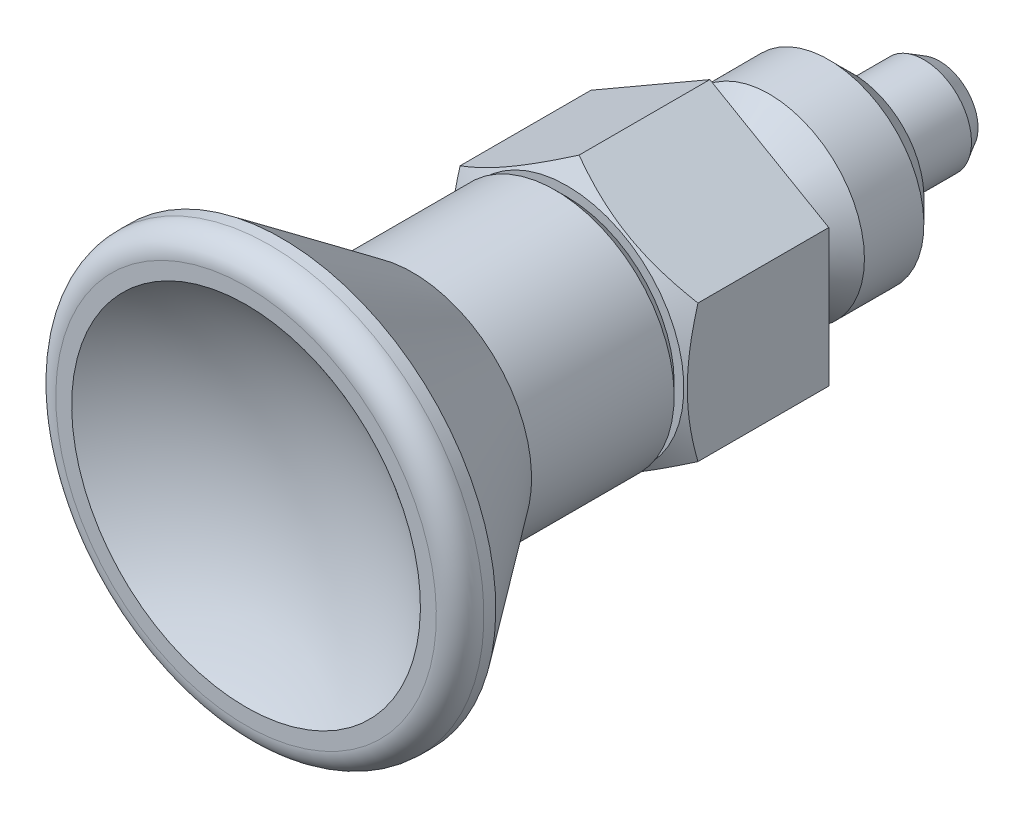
ISO-10303-21;
HEADER;
FILE_DESCRIPTION(('STEP AP214'),'2;1');
FILE_NAME('part.step','',(''),(''),'','','');
FILE_SCHEMA(('AUTOMOTIVE_DESIGN { 1 0 10303 214 1 1 1 1 }'));
ENDSEC;
DATA;
#1=APPLICATION_CONTEXT('core data for automotive mechanical design processes');
#2=APPLICATION_PROTOCOL_DEFINITION('international standard','automotive_design',2000,#1);
#3=PRODUCT_CONTEXT('',#1,'mechanical');
#4=PRODUCT('Part','Part','',(#3));
#5=PRODUCT_RELATED_PRODUCT_CATEGORY('part','',(#4));
#6=PRODUCT_DEFINITION_FORMATION('','',#4);
#7=PRODUCT_DEFINITION_CONTEXT('part definition',#1,'design');
#8=PRODUCT_DEFINITION('design','',#6,#7);
#9=PRODUCT_DEFINITION_SHAPE('','',#8);
#10=(LENGTH_UNIT() NAMED_UNIT(*) SI_UNIT(.MILLI.,.METRE.));
#11=(NAMED_UNIT(*) PLANE_ANGLE_UNIT() SI_UNIT($,.RADIAN.));
#12=(NAMED_UNIT(*) SI_UNIT($,.STERADIAN.) SOLID_ANGLE_UNIT());
#13=UNCERTAINTY_MEASURE_WITH_UNIT(LENGTH_MEASURE(1.E-05),#10,'distance_accuracy_value','');
#14=(GEOMETRIC_REPRESENTATION_CONTEXT(3) GLOBAL_UNCERTAINTY_ASSIGNED_CONTEXT((#13)) GLOBAL_UNIT_ASSIGNED_CONTEXT((#10,
#11,#12)) REPRESENTATION_CONTEXT('',''));
#15=CARTESIAN_POINT('',(0.,0.,0.));
#16=DIRECTION('',(0.,0.,1.));
#17=DIRECTION('',(1.,0.,0.));
#18=AXIS2_PLACEMENT_3D('',#15,#16,#17);
#19=CARTESIAN_POINT('',(0.,0.,-5.9999999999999));
#20=DIRECTION('',(-1.,0.,0.));
#21=DIRECTION('',(0.,1.,0.));
#22=AXIS2_PLACEMENT_3D('',#19,#20,#21);
#23=SPHERICAL_SURFACE('',#22,4.00000000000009);
#24=CARTESIAN_POINT('',(0.,0.,-9.65695305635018));
#25=DIRECTION('',(0.,0.,1.));
#26=DIRECTION('',(-1.,0.,0.));
#27=AXIS2_PLACEMENT_3D('',#24,#25,#26);
#28=CIRCLE('',#27,1.62070797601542);
#29=CARTESIAN_POINT('',(-1.62070797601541,0.,-9.65695305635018));
#30=VERTEX_POINT('',#29);
#31=EDGE_CURVE('E18',#30,#30,#28,.T.);
#32=ORIENTED_EDGE('',*,*,#31,.F.);
#33=EDGE_LOOP('',(#32));
#34=FACE_BOUND('',#33,.T.);
#35=ADVANCED_FACE('F14',(#34),#23,.T.);
#36=CARTESIAN_POINT('',(0.,0.,-9.00000000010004));
#37=DIRECTION('',(0.,0.,1.));
#38=DIRECTION('',(-1.,0.,0.));
#39=AXIS2_PLACEMENT_3D('',#36,#37,#38);
#40=CONICAL_SURFACE('',#39,1.99999999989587,0.523598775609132);
#41=CARTESIAN_POINT('',(0.,0.,-9.));
#42=DIRECTION('',(0.,0.,1.));
#43=DIRECTION('',(0.,-1.,0.));
#44=AXIS2_PLACEMENT_3D('',#41,#42,#43);
#45=CIRCLE('',#44,2.);
#46=CARTESIAN_POINT('',(0.,-2.,-9.));
#47=VERTEX_POINT('',#46);
#48=EDGE_CURVE('E545',#47,#47,#45,.T.);
#49=ORIENTED_EDGE('',*,*,#48,.F.);
#50=EDGE_LOOP('',(#49));
#51=FACE_BOUND('',#50,.T.);
#52=ORIENTED_EDGE('',*,*,#31,.T.);
#53=EDGE_LOOP('',(#52));
#54=FACE_BOUND('',#53,.T.);
#55=ADVANCED_FACE('F177',(#51,#54),#40,.T.);
#56=CARTESIAN_POINT('',(0.,0.,-10.));
#57=DIRECTION('',(0.,0.,1.));
#58=DIRECTION('',(0.,-1.,0.));
#59=AXIS2_PLACEMENT_3D('',#56,#57,#58);
#60=CYLINDRICAL_SURFACE('',#59,2.);
#61=CARTESIAN_POINT('',(0.,0.,-6.));
#62=DIRECTION('',(0.,0.,1.));
#63=DIRECTION('',(0.,-1.,0.));
#64=AXIS2_PLACEMENT_3D('',#61,#62,#63);
#65=CIRCLE('',#64,2.);
#66=CARTESIAN_POINT('',(0.,-2.,-6.));
#67=VERTEX_POINT('',#66);
#68=EDGE_CURVE('E548',#67,#67,#65,.F.);
#69=ORIENTED_EDGE('',*,*,#68,.T.);
#70=EDGE_LOOP('',(#69));
#71=FACE_BOUND('',#70,.T.);
#72=ORIENTED_EDGE('',*,*,#48,.T.);
#73=EDGE_LOOP('',(#72));
#74=FACE_BOUND('',#73,.T.);
#75=ADVANCED_FACE('F174',(#71,#74),#60,.T.);
#76=CARTESIAN_POINT('',(3.,0.,-6.));
#77=DIRECTION('',(0.,0.,1.));
#78=DIRECTION('',(0.,-1.,0.));
#79=AXIS2_PLACEMENT_3D('',#76,#77,#78);
#80=PLANE('',#79);
#81=CARTESIAN_POINT('',(0.,0.,-6.00000000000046));
#82=DIRECTION('',(0.,0.,1.));
#83=DIRECTION('',(0.,-1.,0.));
#84=AXIS2_PLACEMENT_3D('',#81,#82,#83);
#85=CIRCLE('',#84,2.99999999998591);
#86=CARTESIAN_POINT('',(0.,-2.99999999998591,-6.00000000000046));
#87=VERTEX_POINT('',#86);
#88=EDGE_CURVE('E537',#87,#87,#85,.T.);
#89=ORIENTED_EDGE('',*,*,#88,.F.);
#90=EDGE_LOOP('',(#89));
#91=FACE_BOUND('',#90,.T.);
#92=ORIENTED_EDGE('',*,*,#68,.F.);
#93=EDGE_LOOP('',(#92));
#94=FACE_BOUND('',#93,.T.);
#95=ADVANCED_FACE('F170',(#91,#94),#80,.F.);
#96=CARTESIAN_POINT('',(0.,0.,-4.99999999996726));
#97=DIRECTION('',(0.,0.,1.));
#98=DIRECTION('',(0.,-1.,0.));
#99=AXIS2_PLACEMENT_3D('',#96,#97,#98);
#100=CONICAL_SURFACE('',#99,4.0000000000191,0.785398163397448);
#101=CARTESIAN_POINT('',(0.,0.,-5.));
#102=DIRECTION('',(0.,0.,1.));
#103=DIRECTION('',(0.,-1.,0.));
#104=AXIS2_PLACEMENT_3D('',#101,#102,#103);
#105=CIRCLE('',#104,4.);
#106=CARTESIAN_POINT('',(0.,-4.,-5.));
#107=VERTEX_POINT('',#106);
#108=EDGE_CURVE('E532',#107,#107,#105,.T.);
#109=ORIENTED_EDGE('',*,*,#108,.F.);
#110=EDGE_LOOP('',(#109));
#111=FACE_BOUND('',#110,.T.);
#112=ORIENTED_EDGE('',*,*,#88,.T.);
#113=EDGE_LOOP('',(#112));
#114=FACE_BOUND('',#113,.T.);
#115=ADVANCED_FACE('F166',(#111,#114),#100,.T.);
#116=CARTESIAN_POINT('',(0.,0.,-6.));
#117=DIRECTION('',(0.,0.,1.));
#118=DIRECTION('',(0.,-1.,0.));
#119=AXIS2_PLACEMENT_3D('',#116,#117,#118);
#120=CYLINDRICAL_SURFACE('',#119,4.);
#121=CARTESIAN_POINT('',(0.,0.,-2.50000000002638));
#122=DIRECTION('',(0.,0.,-1.));
#123=DIRECTION('',(0.,1.,0.));
#124=AXIS2_PLACEMENT_3D('',#121,#122,#123);
#125=CIRCLE('',#124,4.0000000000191);
#126=CARTESIAN_POINT('',(0.,4.0000000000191,-2.50000000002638));
#127=VERTEX_POINT('',#126);
#128=EDGE_CURVE('E530',#127,#127,#125,.F.);
#129=ORIENTED_EDGE('',*,*,#128,.F.);
#130=EDGE_LOOP('',(#129));
#131=FACE_BOUND('',#130,.T.);
#132=ORIENTED_EDGE('',*,*,#108,.T.);
#133=EDGE_LOOP('',(#132));
#134=FACE_BOUND('',#133,.T.);
#135=ADVANCED_FACE('F162',(#131,#134),#120,.T.);
#136=CARTESIAN_POINT('',(0.,0.,-2.49999999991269));
#137=DIRECTION('',(0.,0.,-1.));
#138=DIRECTION('',(0.,1.,0.));
#139=AXIS2_PLACEMENT_3D('',#136,#137,#138);
#140=CONICAL_SURFACE('',#139,3.99999999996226,0.698131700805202);
#141=CARTESIAN_POINT('',(0.,0.,-1.35636147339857));
#142=DIRECTION('',(0.,0.,-1.));
#143=DIRECTION('',(0.,1.,0.));
#144=AXIS2_PLACEMENT_3D('',#141,#142,#143);
#145=CIRCLE('',#144,3.04037333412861);
#146=CARTESIAN_POINT('',(0.,3.04037333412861,-1.35636147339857));
#147=VERTEX_POINT('',#146);
#148=EDGE_CURVE('E149',#147,#147,#145,.T.);
#149=ORIENTED_EDGE('',*,*,#148,.T.);
#150=EDGE_LOOP('',(#149));
#151=FACE_BOUND('',#150,.T.);
#152=ORIENTED_EDGE('',*,*,#128,.T.);
#153=EDGE_LOOP('',(#152));
#154=FACE_BOUND('',#153,.T.);
#155=ADVANCED_FACE('F158',(#151,#154),#140,.T.);
#156=CARTESIAN_POINT('',(0.,0.,-0.97068890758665));
#157=DIRECTION('',(0.,0.,-1.));
#158=DIRECTION('',(0.,1.,0.));
#159=AXIS2_PLACEMENT_3D('',#156,#157,#158);
#160=TOROIDAL_SURFACE('',#159,3.5,0.6);
#161=CARTESIAN_POINT('',(0.,0.,-0.97068890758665));
#162=DIRECTION('',(0.,0.,1.));
#163=DIRECTION('',(0.,-1.,0.));
#164=AXIS2_PLACEMENT_3D('',#161,#162,#163);
#165=CIRCLE('',#164,2.9);
#166=CARTESIAN_POINT('',(0.,-2.9,-0.97068890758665));
#167=VERTEX_POINT('',#166);
#168=EDGE_CURVE('E136',#167,#167,#165,.T.);
#169=ORIENTED_EDGE('',*,*,#168,.F.);
#170=EDGE_LOOP('',(#169));
#171=FACE_BOUND('',#170,.T.);
#172=ORIENTED_EDGE('',*,*,#148,.F.);
#173=EDGE_LOOP('',(#172));
#174=FACE_BOUND('',#173,.T.);
#175=ADVANCED_FACE('F155',(#171,#174),#160,.F.);
#176=CARTESIAN_POINT('',(0.,0.,-6.));
#177=DIRECTION('',(0.,0.,1.));
#178=DIRECTION('',(0.,-1.,0.));
#179=AXIS2_PLACEMENT_3D('',#176,#177,#178);
#180=CYLINDRICAL_SURFACE('',#179,2.9);
#181=CARTESIAN_POINT('',(0.,0.,-0.6));
#182=DIRECTION('',(0.,0.,-1.));
#183=DIRECTION('',(0.,1.,0.));
#184=AXIS2_PLACEMENT_3D('',#181,#182,#183);
#185=CIRCLE('',#184,2.9);
#186=CARTESIAN_POINT('',(0.,2.9,-0.6));
#187=VERTEX_POINT('',#186);
#188=EDGE_CURVE('E133',#187,#187,#185,.T.);
#189=ORIENTED_EDGE('',*,*,#188,.T.);
#190=EDGE_LOOP('',(#189));
#191=FACE_BOUND('',#190,.T.);
#192=ORIENTED_EDGE('',*,*,#168,.T.);
#193=EDGE_LOOP('',(#192));
#194=FACE_BOUND('',#193,.T.);
#195=ADVANCED_FACE('F126',(#191,#194),#180,.T.);
#196=CARTESIAN_POINT('',(0.,0.,-0.6));
#197=DIRECTION('',(0.,0.,-1.));
#198=DIRECTION('',(0.,1.,0.));
#199=AXIS2_PLACEMENT_3D('',#196,#197,#198);
#200=TOROIDAL_SURFACE('',#199,3.5,0.6);
#201=CARTESIAN_POINT('',(0.,0.,0.));
#202=DIRECTION('',(0.,0.,-1.));
#203=DIRECTION('',(0.,1.,0.));
#204=AXIS2_PLACEMENT_3D('',#201,#202,#203);
#205=CIRCLE('',#204,3.5);
#206=CARTESIAN_POINT('',(0.,3.5,0.));
#207=VERTEX_POINT('',#206);
#208=EDGE_CURVE('E81',#207,#207,#205,.T.);
#209=ORIENTED_EDGE('',*,*,#208,.T.);
#210=EDGE_LOOP('',(#209));
#211=FACE_BOUND('',#210,.T.);
#212=ORIENTED_EDGE('',*,*,#188,.F.);
#213=EDGE_LOOP('',(#212));
#214=FACE_BOUND('',#213,.T.);
#215=ADVANCED_FACE('F119',(#211,#214),#200,.F.);
#216=CARTESIAN_POINT('',(15.,0.,0.));
#217=DIRECTION('',(0.,0.,1.));
#218=DIRECTION('',(0.,-1.,0.));
#219=AXIS2_PLACEMENT_3D('',#216,#217,#218);
#220=PLANE('',#219);
#221=DIRECTION('',(-0.866025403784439,0.5,0.));
#222=VECTOR('',#221,1.);
#223=CARTESIAN_POINT('',(5.,2.88675134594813,0.));
#224=LINE('',#223,#222);
#225=CARTESIAN_POINT('',(5.,2.88675134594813,0.));
#226=VERTEX_POINT('',#225);
#227=CARTESIAN_POINT('',(0.,5.77350269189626,0.));
#228=VERTEX_POINT('',#227);
#229=EDGE_CURVE('E88',#226,#228,#224,.T.);
#230=ORIENTED_EDGE('',*,*,#229,.F.);
#231=DIRECTION('',(0.,1.,0.));
#232=VECTOR('',#231,1.);
#233=CARTESIAN_POINT('',(5.,-2.88675134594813,0.));
#234=LINE('',#233,#232);
#235=CARTESIAN_POINT('',(5.,-2.88675134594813,0.));
#236=VERTEX_POINT('',#235);
#237=EDGE_CURVE('E84',#236,#226,#234,.T.);
#238=ORIENTED_EDGE('',*,*,#237,.F.);
#239=DIRECTION('',(0.866025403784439,0.5,0.));
#240=VECTOR('',#239,1.);
#241=CARTESIAN_POINT('',(0.,-5.77350269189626,0.));
#242=LINE('',#241,#240);
#243=CARTESIAN_POINT('',(0.,-5.77350269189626,0.));
#244=VERTEX_POINT('',#243);
#245=EDGE_CURVE('E60',#244,#236,#242,.T.);
#246=ORIENTED_EDGE('',*,*,#245,.F.);
#247=DIRECTION('',(0.866025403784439,-0.5,0.));
#248=VECTOR('',#247,1.);
#249=CARTESIAN_POINT('',(-5.,-2.88675134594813,0.));
#250=LINE('',#249,#248);
#251=CARTESIAN_POINT('',(-5.,-2.88675134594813,0.));
#252=VERTEX_POINT('',#251);
#253=EDGE_CURVE('E100',#252,#244,#250,.T.);
#254=ORIENTED_EDGE('',*,*,#253,.F.);
#255=DIRECTION('',(0.,-1.,0.));
#256=VECTOR('',#255,1.);
#257=CARTESIAN_POINT('',(-5.,2.88675134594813,0.));
#258=LINE('',#257,#256);
#259=CARTESIAN_POINT('',(-5.,2.88675134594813,0.));
#260=VERTEX_POINT('',#259);
#261=EDGE_CURVE('E65',#260,#252,#258,.T.);
#262=ORIENTED_EDGE('',*,*,#261,.F.);
#263=DIRECTION('',(-0.866025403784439,-0.5,0.));
#264=VECTOR('',#263,1.);
#265=CARTESIAN_POINT('',(0.,5.77350269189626,0.));
#266=LINE('',#265,#264);
#267=EDGE_CURVE('E266',#228,#260,#266,.T.);
#268=ORIENTED_EDGE('',*,*,#267,.F.);
#269=EDGE_LOOP('',(#230,#238,#246,#254,#262,#268));
#270=FACE_BOUND('',#269,.T.);
#271=ORIENTED_EDGE('',*,*,#208,.F.);
#272=EDGE_LOOP('',(#271));
#273=FACE_BOUND('',#272,.T.);
#274=ADVANCED_FACE('F85',(#270,#273),#220,.F.);
#275=CARTESIAN_POINT('',(0.,-5.77350269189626,0.));
#276=DIRECTION('',(0.5,-0.866025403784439,0.));
#277=DIRECTION('',(0.866025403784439,0.5,0.));
#278=AXIS2_PLACEMENT_3D('',#275,#276,#277);
#279=PLANE('',#278);
#280=ORIENTED_EDGE('',*,*,#245,.T.);
#281=DIRECTION('',(0.,0.,1.));
#282=VECTOR('',#281,1.);
#283=CARTESIAN_POINT('',(5.,-2.88675134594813,0.));
#284=LINE('',#283,#282);
#285=CARTESIAN_POINT('',(5.,-2.88675136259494,5.49999999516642));
#286=VERTEX_POINT('',#285);
#287=EDGE_CURVE('E77',#286,#236,#284,.F.);
#288=ORIENTED_EDGE('',*,*,#287,.F.);
#289=CARTESIAN_POINT('',(7.49970832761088E-08,-5.77350264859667,5.50000002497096));
#290=CARTESIAN_POINT('',(0.219731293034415,-5.64664077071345,5.57325663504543));
#291=CARTESIAN_POINT('',(0.441341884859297,-5.51869383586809,5.63988606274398));
#292=CARTESIAN_POINT('',(0.888400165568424,-5.26058461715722,5.75618631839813));
#293=CARTESIAN_POINT('',(1.11385579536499,-5.13041774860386,5.80581600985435));
#294=CARTESIAN_POINT('',(1.56200741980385,-4.87167728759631,5.88305567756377));
#295=CARTESIAN_POINT('',(1.78463363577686,-4.74314398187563,5.91118017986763));
#296=CARTESIAN_POINT('',(2.11935576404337,-4.54989207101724,5.93639673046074));
#297=CARTESIAN_POINT('',(2.23100612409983,-4.48543070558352,5.94197527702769));
#298=CARTESIAN_POINT('',(2.45440991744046,-4.35644846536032,5.947380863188));
#299=CARTESIAN_POINT('',(2.56616334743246,-4.29192759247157,5.94720808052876));
#300=CARTESIAN_POINT('',(2.87231042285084,-4.11517349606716,5.93882025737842));
#301=CARTESIAN_POINT('',(3.06660254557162,-4.00299888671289,5.92474300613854));
#302=CARTESIAN_POINT('',(3.4538973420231,-3.77939413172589,5.88011052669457));
#303=CARTESIAN_POINT('',(3.64689865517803,-3.66796477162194,5.84954005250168));
#304=CARTESIAN_POINT('',(4.0349732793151,-3.44390978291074,5.77312430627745));
#305=CARTESIAN_POINT('',(4.22999763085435,-3.33131242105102,5.72695534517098));
#306=CARTESIAN_POINT('',(4.61713839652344,-3.10779659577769,5.62217116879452));
#307=CARTESIAN_POINT('',(4.8092597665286,-2.99687527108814,5.56358055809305));
#308=CARTESIAN_POINT('',(4.99999992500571,-2.88675138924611,5.50000002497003));
#309=B_SPLINE_CURVE_WITH_KNOTS('',3,(#289,#290,#291,#292,#293,#294,#295,#296,#297,#298,#299,
#300,#301,#302,#303,#304,#305,#306,#307,#308),.UNSPECIFIED.,.F.,.F.,(4,2,2,2,2,2,2,2,2,4),(0.,
0.792540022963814,1.58698453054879,2.3617689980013,2.74878731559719,3.13579367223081,
3.80946086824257,4.48375185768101,5.17299538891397,5.86088622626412),.UNSPECIFIED.);
#310=CARTESIAN_POINT('',(3.74985425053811E-08,-5.77350267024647,5.50000001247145));
#311=VERTEX_POINT('',#310);
#312=EDGE_CURVE('E52',#311,#286,#309,.T.);
#313=ORIENTED_EDGE('',*,*,#312,.F.);
#314=DIRECTION('',(0.,0.,1.));
#315=VECTOR('',#314,1.);
#316=CARTESIAN_POINT('',(0.,-5.77350269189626,0.));
#317=LINE('',#316,#315);
#318=EDGE_CURVE('E79',#244,#311,#317,.T.);
#319=ORIENTED_EDGE('',*,*,#318,.F.);
#320=EDGE_LOOP('',(#280,#288,#313,#319));
#321=FACE_BOUND('',#320,.T.);
#322=ADVANCED_FACE('F75',(#321),#279,.T.);
#323=CARTESIAN_POINT('',(5.,-2.88675134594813,0.));
#324=DIRECTION('',(1.,0.,0.));
#325=DIRECTION('',(0.,1.,0.));
#326=AXIS2_PLACEMENT_3D('',#323,#324,#325);
#327=PLANE('',#326);
#328=ORIENTED_EDGE('',*,*,#237,.T.);
#329=DIRECTION('',(0.,0.,1.));
#330=VECTOR('',#329,1.);
#331=CARTESIAN_POINT('',(5.,2.88675134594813,0.));
#332=LINE('',#331,#330);
#333=CARTESIAN_POINT('',(5.00000001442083,2.88675133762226,5.49999999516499));
#334=VERTEX_POINT('',#333);
#335=EDGE_CURVE('E91',#334,#226,#332,.F.);
#336=ORIENTED_EDGE('',*,*,#335,.F.);
#337=CARTESIAN_POINT('',(4.99999996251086,-2.88675137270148,5.49999996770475));
#338=CARTESIAN_POINT('',(4.9999999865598,-2.63302761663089,5.57325659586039));
#339=CARTESIAN_POINT('',(4.99999999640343,-2.37713374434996,5.63988603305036));
#340=CARTESIAN_POINT('',(5.00000000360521,-1.86091529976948,5.75618629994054));
#341=CARTESIAN_POINT('',(5.0000000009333,-1.60058155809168,5.8058159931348));
#342=CARTESIAN_POINT('',(4.9999999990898,-1.08310062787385,5.8830556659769));
#343=CARTESIAN_POINT('',(4.99999999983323,-0.826034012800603,5.9111801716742));
#344=CARTESIAN_POINT('',(5.0000000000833,-0.439530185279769,5.93639672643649));
#345=CARTESIAN_POINT('',(5.00000000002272,-0.310607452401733,5.94197527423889));
#346=CARTESIAN_POINT('',(4.99999999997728,-0.0526429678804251,5.94738086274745));
#347=CARTESIAN_POINT('',(4.99999999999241,0.0763987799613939,5.94720808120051));
#348=CARTESIAN_POINT('',(5.00000000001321,0.42990698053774,5.93882026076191));
#349=CARTESIAN_POINT('',(5.00000000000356,0.654256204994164,5.92474301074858));
#350=CARTESIAN_POINT('',(4.99999999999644,1.10146572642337,5.88011053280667));
#351=CARTESIAN_POINT('',(4.99999999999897,1.32432445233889,5.84954005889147));
#352=CARTESIAN_POINT('',(5.00000000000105,1.77243444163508,5.7731243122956));
#353=CARTESIAN_POINT('',(5.00000000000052,1.99762917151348,5.72695535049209));
#354=CARTESIAN_POINT('',(4.99999999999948,2.44466083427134,5.62217117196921));
#355=CARTESIAN_POINT('',(4.99999999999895,2.66650348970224,5.56358055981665));
#356=CARTESIAN_POINT('',(5.,2.88675125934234,5.50000002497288));
#357=B_SPLINE_CURVE_WITH_KNOTS('',3,(#337,#338,#339,#340,#341,#342,#343,#344,#345,#346,#347,
#348,#349,#350,#351,#352,#353,#354,#355,#356),.UNSPECIFIED.,.F.,.F.,(4,2,2,2,2,2,2,2,2,4),(0.,
0.792540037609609,1.58698455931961,2.36176903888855,2.74878736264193,3.13579372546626,
3.80946093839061,4.48375194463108,5.17299549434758,5.86088635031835),.UNSPECIFIED.);
#358=EDGE_CURVE('E95',#286,#334,#357,.T.);
#359=ORIENTED_EDGE('',*,*,#358,.F.);
#360=ORIENTED_EDGE('',*,*,#287,.T.);
#361=EDGE_LOOP('',(#328,#336,#359,#360));
#362=FACE_BOUND('',#361,.T.);
#363=ADVANCED_FACE('F93',(#362),#327,.T.);
#364=CARTESIAN_POINT('',(5.,2.88675134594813,0.));
#365=DIRECTION('',(0.5,0.866025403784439,0.));
#366=DIRECTION('',(-0.866025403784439,0.5,0.));
#367=AXIS2_PLACEMENT_3D('',#364,#365,#366);
#368=PLANE('',#367);
#369=ORIENTED_EDGE('',*,*,#229,.T.);
#370=DIRECTION('',(0.,0.,1.));
#371=VECTOR('',#370,1.);
#372=CARTESIAN_POINT('',(0.,5.77350269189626,0.));
#373=LINE('',#372,#371);
#374=CARTESIAN_POINT('',(-1.15520045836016E-08,5.77350268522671,5.5000000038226));
#375=VERTEX_POINT('',#374);
#376=EDGE_CURVE('E267',#375,#228,#373,.F.);
#377=ORIENTED_EDGE('',*,*,#376,.F.);
#378=CARTESIAN_POINT('',(5.00000000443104,2.88675130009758,5.49999996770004));
#379=CARTESIAN_POINT('',(4.78026879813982,3.01361319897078,5.57325659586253));
#380=CARTESIAN_POINT('',(4.55865820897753,3.14156014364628,5.63988603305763));
#381=CARTESIAN_POINT('',(4.11159992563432,3.39966937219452,5.75618629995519));
#382=CARTESIAN_POINT('',(3.88614429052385,3.52983624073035,5.80581599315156));
#383=CARTESIAN_POINT('',(3.43799265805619,3.78857670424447,5.88305566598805));
#384=CARTESIAN_POINT('',(3.21536643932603,3.9171100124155,5.9111801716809));
#385=CARTESIAN_POINT('',(2.88064430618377,4.1103619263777,5.93639672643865));
#386=CARTESIAN_POINT('',(2.76899394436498,4.17482329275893,5.94197527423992));
#387=CARTESIAN_POINT('',(2.54559014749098,4.30380553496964,5.94738086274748));
#388=CARTESIAN_POINT('',(2.43383671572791,4.36832640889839,5.94720808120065));
#389=CARTESIAN_POINT('',(2.1276896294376,4.54508051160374,5.93882026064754));
#390=CARTESIAN_POINT('',(1.93339749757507,4.65725512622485,5.92474301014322));
#391=CARTESIAN_POINT('',(1.54610268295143,4.88085989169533,5.88011053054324));
#392=CARTESIAN_POINT('',(1.35310136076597,4.99228925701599,5.84954005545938));
#393=CARTESIAN_POINT('',(0.965026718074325,5.21634425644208,5.77312430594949));
#394=CARTESIAN_POINT('',(0.770002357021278,5.32894162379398,5.72695534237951));
#395=CARTESIAN_POINT('',(0.382861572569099,5.55245745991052,5.62217115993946));
#396=CARTESIAN_POINT('',(0.190740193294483,5.6633787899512,5.56358054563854));
#397=CARTESIAN_POINT('',(2.56882416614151E-08,5.77350267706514,5.50000000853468));
#398=B_SPLINE_CURVE_WITH_KNOTS('',3,(#378,#379,#380,#381,#382,#383,#384,#385,#386,#387,#388,
#389,#390,#391,#392,#393,#394,#395,#396,#397),.UNSPECIFIED.,.F.,.F.,(4,2,2,2,2,2,2,2,2,4),(0.,
0.792540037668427,1.5869845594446,2.36176903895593,2.74878736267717,3.13579372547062,
3.80946095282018,4.48375197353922,5.17299553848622,5.86088640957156),.UNSPECIFIED.);
#399=EDGE_CURVE('E275',#334,#375,#398,.T.);
#400=ORIENTED_EDGE('',*,*,#399,.F.);
#401=ORIENTED_EDGE('',*,*,#335,.T.);
#402=EDGE_LOOP('',(#369,#377,#400,#401));
#403=FACE_BOUND('',#402,.T.);
#404=ADVANCED_FACE('F273',(#403),#368,.T.);
#405=CARTESIAN_POINT('',(0.,5.77350269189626,0.));
#406=DIRECTION('',(-0.5,0.866025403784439,0.));
#407=DIRECTION('',(-0.866025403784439,-0.5,0.));
#408=AXIS2_PLACEMENT_3D('',#405,#406,#407);
#409=PLANE('',#408);
#410=ORIENTED_EDGE('',*,*,#267,.T.);
#411=DIRECTION('',(0.,0.,1.));
#412=VECTOR('',#411,1.);
#413=CARTESIAN_POINT('',(-5.,2.88675134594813,0.));
#414=LINE('',#413,#412);
#415=CARTESIAN_POINT('',(-5.,2.8867513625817,5.49999999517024));
#416=VERTEX_POINT('',#415);
#417=EDGE_CURVE('E265',#416,#260,#414,.F.);
#418=ORIENTED_EDGE('',*,*,#417,.F.);
#419=CARTESIAN_POINT('',(-1.65578153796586E-08,5.77350266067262,5.49999999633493));
#420=CARTESIAN_POINT('',(-0.219731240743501,5.64664079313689,5.57325661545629));
#421=CARTESIAN_POINT('',(-0.441341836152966,5.51869386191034,5.63988604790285));
#422=CARTESIAN_POINT('',(-0.888400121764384,5.26058464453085,5.75618630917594));
#423=CARTESIAN_POINT('',(-1.11385575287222,5.1304177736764,5.80581600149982));
#424=CARTESIAN_POINT('',(-1.56200738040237,4.87167730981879,5.88305567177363));
#425=CARTESIAN_POINT('',(-1.78463359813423,4.74314400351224,5.91118017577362));
#426=CARTESIAN_POINT('',(-2.11935572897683,4.54989209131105,5.93639672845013));
#427=CARTESIAN_POINT('',(-2.23100608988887,4.48543072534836,5.94197527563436));
#428=CARTESIAN_POINT('',(-2.45440988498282,4.35644848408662,5.94738086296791));
#429=CARTESIAN_POINT('',(-2.56616331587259,4.2919276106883,5.94720808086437));
#430=CARTESIAN_POINT('',(-2.87231039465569,4.11517351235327,5.93882025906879));
#431=CARTESIAN_POINT('',(-3.06660251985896,4.00299890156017,5.92474300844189));
#432=CARTESIAN_POINT('',(-3.45389732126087,3.77939414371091,5.88011052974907));
#433=CARTESIAN_POINT('',(-3.6468986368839,3.66796478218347,5.84954005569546));
#434=CARTESIAN_POINT('',(-4.03497326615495,3.44390979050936,5.77312430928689));
#435=CARTESIAN_POINT('',(-4.22999762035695,3.331312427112,5.72695534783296));
#436=CARTESIAN_POINT('',(-4.61713839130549,3.10779659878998,5.62217117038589));
#437=CARTESIAN_POINT('',(-4.80925976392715,2.99687527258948,5.5635805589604));
#438=CARTESIAN_POINT('',(-4.99999992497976,2.88675138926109,5.50000002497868));
#439=B_SPLINE_CURVE_WITH_KNOTS('',3,(#419,#420,#421,#422,#423,#424,#425,#426,#427,#428,#429,
#430,#431,#432,#433,#434,#435,#436,#437,#438),.UNSPECIFIED.,.F.,.F.,(4,2,2,2,2,2,2,2,2,4),(0.,
0.792540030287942,1.58698454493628,2.3617690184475,2.74878733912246,3.13579369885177,
3.80946090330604,4.48375190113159,5.17299544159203,5.86088628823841),.UNSPECIFIED.);
#440=EDGE_CURVE('E278',#375,#416,#439,.T.);
#441=ORIENTED_EDGE('',*,*,#440,.F.);
#442=ORIENTED_EDGE('',*,*,#376,.T.);
#443=EDGE_LOOP('',(#410,#418,#441,#442));
#444=FACE_BOUND('',#443,.T.);
#445=ADVANCED_FACE('F304',(#444),#409,.T.);
#446=CARTESIAN_POINT('',(-5.,2.88675134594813,0.));
#447=DIRECTION('',(-1.,0.,0.));
#448=DIRECTION('',(0.,-1.,0.));
#449=AXIS2_PLACEMENT_3D('',#446,#447,#448);
#450=PLANE('',#449);
#451=ORIENTED_EDGE('',*,*,#261,.T.);
#452=DIRECTION('',(0.,0.,1.));
#453=VECTOR('',#452,1.);
#454=CARTESIAN_POINT('',(-5.,-2.88675134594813,0.));
#455=LINE('',#454,#453);
#456=CARTESIAN_POINT('',(-5.00000001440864,-2.8867513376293,5.49999999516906));
#457=VERTEX_POINT('',#456);
#458=EDGE_CURVE('E33',#457,#252,#455,.F.);
#459=ORIENTED_EDGE('',*,*,#458,.F.);
#460=CARTESIAN_POINT('',(-4.99999996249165,2.88675137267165,5.49999996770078));
#461=CARTESIAN_POINT('',(-4.99999998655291,2.63302761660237,5.57325659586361));
#462=CARTESIAN_POINT('',(-4.99999999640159,2.37713374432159,5.63988603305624));
#463=CARTESIAN_POINT('',(-5.00000000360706,1.86091529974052,5.75618629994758));
#464=CARTESIAN_POINT('',(-5.00000000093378,1.60058155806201,5.80581599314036));
#465=CARTESIAN_POINT('',(-4.99999999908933,1.08310062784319,5.88305566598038));
#466=CARTESIAN_POINT('',(-4.99999999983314,0.826034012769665,5.91118017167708));
#467=CARTESIAN_POINT('',(-5.00000000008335,0.439530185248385,5.93639672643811));
#468=CARTESIAN_POINT('',(-5.00000000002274,0.310607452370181,5.94197527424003));
#469=CARTESIAN_POINT('',(-4.99999999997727,0.0526429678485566,5.94738086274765));
#470=CARTESIAN_POINT('',(-4.99999999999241,-0.07639877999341,5.94720808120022));
#471=CARTESIAN_POINT('',(-5.00000000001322,-0.42990698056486,5.93882026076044));
#472=CARTESIAN_POINT('',(-5.00000000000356,-0.654256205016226,5.9247430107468));
#473=CARTESIAN_POINT('',(-4.99999999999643,-1.10146572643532,5.88011053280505));
#474=CARTESIAN_POINT('',(-4.99999999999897,-1.32432445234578,5.84954005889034));
#475=CARTESIAN_POINT('',(-5.00000000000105,-1.77243444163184,5.77312431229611));
#476=CARTESIAN_POINT('',(-5.00000000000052,-1.99762917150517,5.72695535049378));
#477=CARTESIAN_POINT('',(-4.99999999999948,-2.44466083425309,5.62217117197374));
#478=CARTESIAN_POINT('',(-4.99999999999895,-2.66650348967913,5.56358055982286));
#479=CARTESIAN_POINT('',(-5.,-2.88675125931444,5.50000002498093));
#480=B_SPLINE_CURVE_WITH_KNOTS('',3,(#460,#461,#462,#463,#464,#465,#466,#467,#468,#469,#470,
#471,#472,#473,#474,#475,#476,#477,#478,#479),.UNSPECIFIED.,.F.,.F.,(4,2,2,2,2,2,2,2,2,4),(0.,
0.792540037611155,1.58698455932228,2.36176903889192,2.74878736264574,3.13579372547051,
3.80946093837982,4.48375194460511,5.17299549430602,5.86088635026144),.UNSPECIFIED.);
#481=EDGE_CURVE('E315',#416,#457,#480,.T.);
#482=ORIENTED_EDGE('',*,*,#481,.F.);
#483=ORIENTED_EDGE('',*,*,#417,.T.);
#484=EDGE_LOOP('',(#451,#459,#482,#483));
#485=FACE_BOUND('',#484,.T.);
#486=ADVANCED_FACE('F308',(#485),#450,.T.);
#487=CARTESIAN_POINT('',(-5.,-2.88675134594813,0.));
#488=DIRECTION('',(-0.5,-0.866025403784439,0.));
#489=DIRECTION('',(0.866025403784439,-0.5,0.));
#490=AXIS2_PLACEMENT_3D('',#487,#488,#489);
#491=PLANE('',#490);
#492=ORIENTED_EDGE('',*,*,#253,.T.);
#493=ORIENTED_EDGE('',*,*,#318,.T.);
#494=CARTESIAN_POINT('',(-5.00000000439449,-2.8867513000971,5.49999996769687));
#495=CARTESIAN_POINT('',(-4.78026879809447,-3.01361319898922,5.57325659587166));
#496=CARTESIAN_POINT('',(-4.55865820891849,-3.1415601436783,5.63988603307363));
#497=CARTESIAN_POINT('',(-4.11159992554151,-3.39966937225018,5.75618629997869));
#498=CARTESIAN_POINT('',(-3.88614429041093,-3.52983624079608,5.8058159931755));
#499=CARTESIAN_POINT('',(-3.43799265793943,-3.78857670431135,5.88305566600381));
#500=CARTESIAN_POINT('',(-3.21536643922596,-3.91711001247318,5.91118017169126));
#501=CARTESIAN_POINT('',(-2.88064430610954,-4.1103619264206,5.93639672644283));
#502=CARTESIAN_POINT('',(-2.76899394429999,-4.17482329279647,5.94197527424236));
#503=CARTESIAN_POINT('',(-2.54559014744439,-4.30380553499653,5.94738086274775));
#504=CARTESIAN_POINT('',(-2.43383671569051,-4.36832640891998,5.94720808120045));
#505=CARTESIAN_POINT('',(-2.12768962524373,-4.54508051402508,5.93882026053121));
#506=CARTESIAN_POINT('',(-1.93339748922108,-4.65725513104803,5.92474300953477));
#507=CARTESIAN_POINT('',(-1.54610266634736,-4.88085990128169,5.8801105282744));
#508=CARTESIAN_POINT('',(-1.35310134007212,-4.99228926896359,5.84954005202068));
#509=CARTESIAN_POINT('',(-0.965026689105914,-5.216344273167,5.77312429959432));
#510=CARTESIAN_POINT('',(-0.770002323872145,-5.32894164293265,5.72695533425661));
#511=CARTESIAN_POINT('',(-0.382861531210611,-5.55245748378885,5.62217114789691));
#512=CARTESIAN_POINT('',(-0.190740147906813,-5.66337881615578,5.56358053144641));
#513=CARTESIAN_POINT('',(2.36719841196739E-08,-5.77350270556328,5.49999999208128));
#514=B_SPLINE_CURVE_WITH_KNOTS('',3,(#494,#495,#496,#497,#498,#499,#500,#501,#502,#503,#504,
#505,#506,#507,#508,#509,#510,#511,#512,#513),.UNSPECIFIED.,.F.,.F.,(4,2,2,2,2,2,2,2,2,4),(0.,
0.792540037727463,1.58698455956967,2.36176903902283,2.74878736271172,3.13579372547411,
3.80946096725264,4.48375200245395,5.17299558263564,5.86088646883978),.UNSPECIFIED.);
#515=EDGE_CURVE('E320',#457,#311,#514,.T.);
#516=ORIENTED_EDGE('',*,*,#515,.F.);
#517=ORIENTED_EDGE('',*,*,#458,.T.);
#518=EDGE_LOOP('',(#492,#493,#516,#517));
#519=FACE_BOUND('',#518,.T.);
#520=ADVANCED_FACE('F325',(#519),#491,.T.);
#521=CARTESIAN_POINT('',(0.,0.,5.49700000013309));
#522=DIRECTION('',(0.,0.,-1.));
#523=DIRECTION('',(0.,1.,0.));
#524=AXIS2_PLACEMENT_3D('',#521,#522,#523);
#525=CONICAL_SURFACE('',#524,5.77869884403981,1.04719755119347);
#526=CARTESIAN_POINT('',(0.,0.,5.99999999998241));
#527=DIRECTION('',(0.,0.,-1.));
#528=DIRECTION('',(0.,1.,0.));
#529=AXIS2_PLACEMENT_3D('',#526,#527,#528);
#530=CIRCLE('',#529,4.90747728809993);
#531=CARTESIAN_POINT('',(0.,4.90747728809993,5.99999999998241));
#532=VERTEX_POINT('',#531);
#533=EDGE_CURVE('E248',#532,#532,#530,.T.);
#534=ORIENTED_EDGE('',*,*,#533,.T.);
#535=EDGE_LOOP('',(#534));
#536=FACE_BOUND('',#535,.T.);
#537=ORIENTED_EDGE('',*,*,#481,.T.);
#538=ORIENTED_EDGE('',*,*,#515,.T.);
#539=ORIENTED_EDGE('',*,*,#312,.T.);
#540=ORIENTED_EDGE('',*,*,#358,.T.);
#541=ORIENTED_EDGE('',*,*,#399,.T.);
#542=ORIENTED_EDGE('',*,*,#440,.T.);
#543=EDGE_LOOP('',(#537,#538,#539,#540,#541,#542));
#544=FACE_BOUND('',#543,.T.);
#545=ADVANCED_FACE('F255',(#536,#544),#525,.T.);
#546=CARTESIAN_POINT('',(0.,0.,29.));
#547=DIRECTION('',(-1.,0.,0.));
#548=DIRECTION('',(0.,1.,0.));
#549=AXIS2_PLACEMENT_3D('',#546,#547,#548);
#550=SPHERICAL_SURFACE('',#549,12.);
#551=CARTESIAN_POINT('',(0.,7.33143914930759,19.5));
#552=CARTESIAN_POINT('',(-0.205979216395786,7.33144062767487,19.5));
#553=CARTESIAN_POINT('',(-0.411934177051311,7.32275500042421,19.5));
#554=CARTESIAN_POINT('',(-0.822448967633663,7.28807311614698,19.5));
#555=CARTESIAN_POINT('',(-1.02700841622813,7.26207230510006,19.5));
#556=CARTESIAN_POINT('',(-1.43338925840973,7.19290757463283,19.5));
#557=CARTESIAN_POINT('',(-1.63520804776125,7.14972837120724,19.5));
#558=CARTESIAN_POINT('',(-2.03456261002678,7.0464958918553,19.5));
#559=CARTESIAN_POINT('',(-2.2320967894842,6.98643645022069,19.5));
#560=CARTESIAN_POINT('',(-2.62123343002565,6.84993539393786,19.5));
#561=CARTESIAN_POINT('',(-2.81284076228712,6.77350766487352,19.5));
#562=CARTESIAN_POINT('',(-3.18900588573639,6.60475219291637,19.5));
#563=CARTESIAN_POINT('',(-3.37356105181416,6.51241859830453,19.5));
#564=CARTESIAN_POINT('',(-3.7341226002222,6.31258951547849,19.5));
#565=CARTESIAN_POINT('',(-3.91013419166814,6.2051034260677,19.5));
#566=CARTESIAN_POINT('',(-4.25254330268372,5.97564762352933,19.5));
#567=CARTESIAN_POINT('',(-4.41893725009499,5.85367257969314,19.5));
#568=CARTESIAN_POINT('',(-4.7408149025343,5.59617198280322,19.5));
#569=CARTESIAN_POINT('',(-4.89630147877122,5.46065001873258,19.5));
#570=CARTESIAN_POINT('',(-5.19536308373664,5.17693929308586,19.5));
#571=CARTESIAN_POINT('',(-5.33893369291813,5.02874587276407,19.5));
#572=CARTESIAN_POINT('',(-5.61303290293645,4.72084015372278,19.5));
#573=CARTESIAN_POINT('',(-5.74356578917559,4.56113166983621,19.5));
#574=CARTESIAN_POINT('',(-5.99076141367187,4.23122666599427,19.5));
#575=CARTESIAN_POINT('',(-6.10741901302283,4.06102629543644,19.5));
#576=CARTESIAN_POINT('',(-6.32593592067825,3.71146912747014,19.5));
#577=CARTESIAN_POINT('',(-6.427800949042,3.53211590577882,19.5));
#578=CARTESIAN_POINT('',(-6.6160975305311,3.16539948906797,19.5));
#579=CARTESIAN_POINT('',(-6.70252337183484,2.97803336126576,19.5));
#580=CARTESIAN_POINT('',(-6.85925134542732,2.59675511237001,19.5));
#581=CARTESIAN_POINT('',(-6.92955944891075,2.40284544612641,19.5));
#582=CARTESIAN_POINT('',(-7.05361703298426,2.00972472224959,19.5));
#583=CARTESIAN_POINT('',(-7.10736039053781,1.81051173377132,19.5));
#584=CARTESIAN_POINT('',(-7.19785168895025,1.40832460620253,19.5));
#585=CARTESIAN_POINT('',(-7.23460586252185,1.20535187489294,19.5));
#586=CARTESIAN_POINT('',(-7.29090733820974,0.797013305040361,19.5));
#587=CARTESIAN_POINT('',(-7.31044828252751,0.591646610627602,19.5));
#588=CARTESIAN_POINT('',(-7.34293703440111,-0.0257030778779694,19.5));
#589=CARTESIAN_POINT('',(-7.32984889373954,-0.439373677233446,19.5));
#590=CARTESIAN_POINT('',(-7.23440515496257,-1.25842018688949,19.5));
#591=CARTESIAN_POINT('',(-7.15204953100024,-1.66379609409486,19.5));
#592=CARTESIAN_POINT('',(-6.92045134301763,-2.45502887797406,19.5));
#593=CARTESIAN_POINT('',(-6.77120870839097,-2.84088573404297,19.5));
#594=CARTESIAN_POINT('',(-6.41006162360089,-3.58205069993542,19.5));
#595=CARTESIAN_POINT('',(-6.19815719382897,-3.93735881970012,19.5));
#596=CARTESIAN_POINT('',(-5.71770502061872,-4.60736046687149,19.5));
#597=CARTESIAN_POINT('',(-5.44915730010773,-4.92205401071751,19.5));
#598=CARTESIAN_POINT('',(-4.86304090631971,-5.50188805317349,19.5));
#599=CARTESIAN_POINT('',(-4.54547222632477,-5.76702854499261,19.5));
#600=CARTESIAN_POINT('',(-3.87032895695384,-6.24023136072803,19.5));
#601=CARTESIAN_POINT('',(-3.51275436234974,-6.44829367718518,19.5));
#602=CARTESIAN_POINT('',(-2.76774974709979,-6.80143341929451,19.5));
#603=CARTESIAN_POINT('',(-2.38031972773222,-6.94651084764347,19.5));
#604=CARTESIAN_POINT('',(-1.58660228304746,-7.16956260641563,19.5));
#605=CARTESIAN_POINT('',(-1.18031485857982,-7.24753693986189,19.5));
#606=CARTESIAN_POINT('',(-0.360415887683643,-7.33416902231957,19.5));
#607=CARTESIAN_POINT('',(0.0531956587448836,-7.342826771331,19.5));
#608=CARTESIAN_POINT('',(0.876001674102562,-7.29057995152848,19.5));
#609=CARTESIAN_POINT('',(1.28519614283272,-7.22967537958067,19.5));
#610=CARTESIAN_POINT('',(2.08755217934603,-7.04003270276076,19.5));
#611=CARTESIAN_POINT('',(2.48071374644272,-6.91129459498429,19.5));
#612=CARTESIAN_POINT('',(3.23984318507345,-6.58963975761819,19.5));
#613=CARTESIAN_POINT('',(3.60581106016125,-6.39672303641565,19.5));
#614=CARTESIAN_POINT('',(4.30016446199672,-5.95218586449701,19.5));
#615=CARTESIAN_POINT('',(4.62854999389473,-5.70056542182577,19.5));
#616=CARTESIAN_POINT('',(5.23841666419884,-5.14576893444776,19.5));
#617=CARTESIAN_POINT('',(5.51989778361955,-4.84259286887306,19.5));
#618=CARTESIAN_POINT('',(6.02796636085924,-4.19327088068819,19.5));
#619=CARTESIAN_POINT('',(6.25455380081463,-3.84712494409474,19.5));
#620=CARTESIAN_POINT('',(6.64639792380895,-3.12176625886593,19.5));
#621=CARTESIAN_POINT('',(6.81165467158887,-2.74255354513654,19.5));
#622=CARTESIAN_POINT('',(7.07616375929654,-1.96154033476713,19.5));
#623=CARTESIAN_POINT('',(7.17541612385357,-1.55973984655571,19.5));
#624=CARTESIAN_POINT('',(7.27266504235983,-0.949232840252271,19.5));
#625=CARTESIAN_POINT('',(7.29647530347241,-0.74431724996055,19.5));
#626=CARTESIAN_POINT('',(7.32675599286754,-0.333229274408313,19.5));
#627=CARTESIAN_POINT('',(7.33323281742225,-0.127057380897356,19.5));
#628=CARTESIAN_POINT('',(7.32879308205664,0.285160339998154,19.5));
#629=CARTESIAN_POINT('',(7.31787013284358,0.491206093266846,19.5));
#630=CARTESIAN_POINT('',(7.27871054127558,0.901572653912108,19.5));
#631=CARTESIAN_POINT('',(7.25048029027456,1.10589406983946,19.5));
#632=CARTESIAN_POINT('',(7.17689678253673,1.51150746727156,19.5));
#633=CARTESIAN_POINT('',(7.13153717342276,1.71279829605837,19.5));
#634=CARTESIAN_POINT('',(7.02403888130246,2.11076896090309,19.5));
#635=CARTESIAN_POINT('',(6.96190639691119,2.30745047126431,19.5));
#636=CARTESIAN_POINT('',(6.82126899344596,2.69495656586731,19.5));
#637=CARTESIAN_POINT('',(6.74275773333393,2.88577884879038,19.5));
#638=CARTESIAN_POINT('',(6.56996778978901,3.26006032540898,19.5));
#639=CARTESIAN_POINT('',(6.47569493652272,3.44352221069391,19.5));
#640=CARTESIAN_POINT('',(6.2719978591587,3.80191279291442,19.5));
#641=CARTESIAN_POINT('',(6.16256864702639,3.97683865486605,19.5));
#642=CARTESIAN_POINT('',(5.92940387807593,4.31678543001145,19.5));
#643=CARTESIAN_POINT('',(5.80567361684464,4.48180997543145,19.5));
#644=CARTESIAN_POINT('',(5.54471896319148,4.80089374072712,19.5));
#645=CARTESIAN_POINT('',(5.40749101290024,4.95495005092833,19.5));
#646=CARTESIAN_POINT('',(5.12059718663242,5.25089919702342,19.5));
#647=CARTESIAN_POINT('',(4.97093591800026,5.39279649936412,19.5));
#648=CARTESIAN_POINT('',(4.66009879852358,5.66356684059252,19.5));
#649=CARTESIAN_POINT('',(4.49891588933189,5.79243177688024,19.5));
#650=CARTESIAN_POINT('',(4.16632566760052,6.03607568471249,19.5));
#651=CARTESIAN_POINT('',(3.99492214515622,6.15085983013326,19.5));
#652=CARTESIAN_POINT('',(3.6429059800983,6.36567249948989,19.5));
#653=CARTESIAN_POINT('',(3.46228567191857,6.465688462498,19.5));
#654=CARTESIAN_POINT('',(3.09332440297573,6.65010265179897,19.5));
#655=CARTESIAN_POINT('',(2.90498628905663,6.73450657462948,19.5));
#656=CARTESIAN_POINT('',(2.52203405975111,6.88707373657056,19.5));
#657=CARTESIAN_POINT('',(2.32742568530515,6.95525137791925,19.5));
#658=CARTESIAN_POINT('',(1.93322420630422,7.07496111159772,19.5));
#659=CARTESIAN_POINT('',(1.73363242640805,7.12649757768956,19.5));
#660=CARTESIAN_POINT('',(1.2806433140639,7.2233023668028,19.5));
#661=CARTESIAN_POINT('',(1.02621667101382,7.26381924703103,19.5));
#662=CARTESIAN_POINT('',(0.514514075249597,7.31788671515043,19.5));
#663=CARTESIAN_POINT('',(0.257238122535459,7.33143730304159,19.5));
#664=CARTESIAN_POINT('',(0.,7.33143914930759,19.5));
#665=B_SPLINE_CURVE_WITH_KNOTS('',3,(#551,#552,#553,#554,#555,#556,#557,#558,#559,#560,#561,
#562,#563,#564,#565,#566,#567,#568,#569,#570,#571,#572,#573,#574,#575,#576,#577,#578,#579,#580,
#581,#582,#583,#584,#585,#586,#587,#588,#589,#590,#591,#592,#593,#594,#595,#596,#597,#598,#599,
#600,#601,#602,#603,#604,#605,#606,#607,#608,#609,#610,#611,#612,#613,#614,#615,#616,#617,#618,
#619,#620,#621,#622,#623,#624,#625,#626,#627,#628,#629,#630,#631,#632,#633,#634,#635,#636,#637,
#638,#639,#640,#641,#642,#643,#644,#645,#646,#647,#648,#649,#650,#651,#652,#653,#654,#655,#656,
#657,#658,#659,#660,#661,#662,#663,#664),.UNSPECIFIED.,.T.,.F.,(4,2,2,2,2,2,2,2,2,2,2,2,2,2,2,2,
2,2,2,2,2,2,2,2,2,2,2,2,2,2,2,2,2,2,2,2,2,2,2,2,2,2,2,2,2,2,2,2,2,2,2,2,2,2,2,2,4),(0.,
0.617712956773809,1.2355884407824,1.85401489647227,2.47266753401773,3.09079741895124,
3.70915519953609,4.32713109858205,4.94533506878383,5.56337569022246,6.18164452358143,
6.7997094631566,7.41800260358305,8.03605601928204,8.65433761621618,9.27238978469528,
9.89067013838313,10.5087234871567,11.1270050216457,12.362238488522,13.5974724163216,
14.8327076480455,16.067942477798,17.303176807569,18.5384113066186,19.7736459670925,
21.0088805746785,22.244115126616,23.4793496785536,24.7145842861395,25.9498189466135,
27.185053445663,28.4202877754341,29.6555226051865,30.8907578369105,32.12599176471,
33.3612252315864,33.9795067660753,34.5975601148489,35.2158404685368,35.8338926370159,
36.45217423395,37.070227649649,37.6885207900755,38.3065857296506,38.9248545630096,
39.5428951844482,40.16109915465,40.779075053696,41.3974328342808,42.0155627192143,
42.6342153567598,43.2526418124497,43.8705172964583,44.4882302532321,45.2596640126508,
46.0310977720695),.UNSPECIFIED.);
#666=CARTESIAN_POINT('',(0.,7.33143914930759,19.5));
#667=VERTEX_POINT('',#666);
#668=EDGE_CURVE('E240',#667,#667,#665,.T.);
#669=ORIENTED_EDGE('',*,*,#668,.T.);
#670=EDGE_LOOP('',(#669));
#671=FACE_BOUND('',#670,.T.);
#672=ADVANCED_FACE('F250',(#671),#550,.F.);
#673=CARTESIAN_POINT('',(0.,0.,6.));
#674=DIRECTION('',(0.,0.,-1.));
#675=DIRECTION('',(0.,1.,0.));
#676=AXIS2_PLACEMENT_3D('',#673,#674,#675);
#677=PLANE('',#676);
#678=CARTESIAN_POINT('',(0.,0.,6.));
#679=DIRECTION('',(0.,0.,1.));
#680=DIRECTION('',(0.,-1.,0.));
#681=AXIS2_PLACEMENT_3D('',#678,#679,#680);
#682=CIRCLE('',#681,4.50000000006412);
#683=CARTESIAN_POINT('',(0.,-4.50000000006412,6.));
#684=VERTEX_POINT('',#683);
#685=EDGE_CURVE('E247',#684,#684,#682,.T.);
#686=ORIENTED_EDGE('',*,*,#685,.F.);
#687=EDGE_LOOP('',(#686));
#688=FACE_BOUND('',#687,.T.);
#689=ORIENTED_EDGE('',*,*,#533,.F.);
#690=EDGE_LOOP('',(#689));
#691=FACE_BOUND('',#690,.T.);
#692=ADVANCED_FACE('F235',(#688,#691),#677,.F.);
#693=CARTESIAN_POINT('',(7.33143914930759,0.,19.5));
#694=DIRECTION('',(0.,0.,-1.));
#695=DIRECTION('',(0.,1.,0.));
#696=AXIS2_PLACEMENT_3D('',#693,#694,#695);
#697=PLANE('',#696);
#698=ORIENTED_EDGE('',*,*,#668,.F.);
#699=EDGE_LOOP('',(#698));
#700=FACE_BOUND('',#699,.T.);
#701=CARTESIAN_POINT('',(0.,0.,19.5));
#702=DIRECTION('',(0.,0.,-1.));
#703=DIRECTION('',(0.,1.,0.));
#704=AXIS2_PLACEMENT_3D('',#701,#702,#703);
#705=CIRCLE('',#704,8.);
#706=CARTESIAN_POINT('',(0.,8.,19.5));
#707=VERTEX_POINT('',#706);
#708=EDGE_CURVE('E222',#707,#707,#705,.T.);
#709=ORIENTED_EDGE('',*,*,#708,.F.);
#710=EDGE_LOOP('',(#709));
#711=FACE_BOUND('',#710,.T.);
#712=ADVANCED_FACE('F226',(#700,#711),#697,.F.);
#713=CARTESIAN_POINT('',(0.,0.,6.49999999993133));
#714=DIRECTION('',(0.,0.,1.));
#715=DIRECTION('',(0.,-1.,0.));
#716=AXIS2_PLACEMENT_3D('',#713,#714,#715);
#717=CONICAL_SURFACE('',#716,4.99999999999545,0.785398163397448);
#718=CARTESIAN_POINT('',(0.,0.,6.5));
#719=DIRECTION('',(0.,0.,1.));
#720=DIRECTION('',(0.,-1.,0.));
#721=AXIS2_PLACEMENT_3D('',#718,#719,#720);
#722=CIRCLE('',#721,5.);
#723=CARTESIAN_POINT('',(0.,-5.,6.5));
#724=VERTEX_POINT('',#723);
#725=EDGE_CURVE('E501',#724,#724,#722,.T.);
#726=ORIENTED_EDGE('',*,*,#725,.F.);
#727=EDGE_LOOP('',(#726));
#728=FACE_BOUND('',#727,.T.);
#729=ORIENTED_EDGE('',*,*,#685,.T.);
#730=EDGE_LOOP('',(#729));
#731=FACE_BOUND('',#730,.T.);
#732=ADVANCED_FACE('F209',(#728,#731),#717,.T.);
#733=CARTESIAN_POINT('',(0.,0.,18.5));
#734=DIRECTION('',(0.,0.,-1.));
#735=DIRECTION('',(0.,1.,0.));
#736=AXIS2_PLACEMENT_3D('',#733,#734,#735);
#737=TOROIDAL_SURFACE('',#736,8.,1.);
#738=CARTESIAN_POINT('',(0.,0.,18.5));
#739=DIRECTION('',(0.,0.,1.));
#740=DIRECTION('',(0.,-1.,0.));
#741=AXIS2_PLACEMENT_3D('',#738,#739,#740);
#742=CIRCLE('',#741,9.);
#743=CARTESIAN_POINT('',(0.,-9.,18.5));
#744=VERTEX_POINT('',#743);
#745=EDGE_CURVE('E505',#744,#744,#742,.F.);
#746=ORIENTED_EDGE('',*,*,#745,.F.);
#747=EDGE_LOOP('',(#746));
#748=FACE_BOUND('',#747,.T.);
#749=ORIENTED_EDGE('',*,*,#708,.T.);
#750=EDGE_LOOP('',(#749));
#751=FACE_BOUND('',#750,.T.);
#752=ADVANCED_FACE('F203',(#748,#751),#737,.T.);
#753=CARTESIAN_POINT('',(0.,0.,-10.));
#754=DIRECTION('',(0.,0.,1.));
#755=DIRECTION('',(0.,-1.,0.));
#756=AXIS2_PLACEMENT_3D('',#753,#754,#755);
#757=CYLINDRICAL_SURFACE('',#756,5.);
#758=CARTESIAN_POINT('',(0.,0.,12.4944723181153));
#759=DIRECTION('',(0.,0.,1.));
#760=DIRECTION('',(0.,-1.,0.));
#761=AXIS2_PLACEMENT_3D('',#758,#759,#760);
#762=CIRCLE('',#761,5.);
#763=CARTESIAN_POINT('',(0.,-5.,12.4944723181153));
#764=VERTEX_POINT('',#763);
#765=EDGE_CURVE('E24',#764,#764,#762,.T.);
#766=ORIENTED_EDGE('',*,*,#765,.F.);
#767=EDGE_LOOP('',(#766));
#768=FACE_BOUND('',#767,.T.);
#769=ORIENTED_EDGE('',*,*,#725,.T.);
#770=EDGE_LOOP('',(#769));
#771=FACE_BOUND('',#770,.T.);
#772=ADVANCED_FACE('F196',(#768,#771),#757,.T.);
#773=CARTESIAN_POINT('',(0.,0.,-10.));
#774=DIRECTION('',(0.,0.,1.));
#775=DIRECTION('',(0.,-1.,0.));
#776=AXIS2_PLACEMENT_3D('',#773,#774,#775);
#777=CYLINDRICAL_SURFACE('',#776,9.);
#778=ORIENTED_EDGE('',*,*,#745,.T.);
#779=EDGE_LOOP('',(#778));
#780=FACE_BOUND('',#779,.T.);
#781=CARTESIAN_POINT('',(0.,0.,18.));
#782=DIRECTION('',(0.,0.,1.));
#783=DIRECTION('',(0.,-1.,0.));
#784=AXIS2_PLACEMENT_3D('',#781,#782,#783);
#785=CIRCLE('',#784,9.);
#786=CARTESIAN_POINT('',(0.,-9.,18.));
#787=VERTEX_POINT('',#786);
#788=EDGE_CURVE('E9',#787,#787,#785,.F.);
#789=ORIENTED_EDGE('',*,*,#788,.F.);
#790=EDGE_LOOP('',(#789));
#791=FACE_BOUND('',#790,.T.);
#792=ADVANCED_FACE('F190',(#780,#791),#777,.T.);
#793=CARTESIAN_POINT('',(0.,0.,18.));
#794=DIRECTION('',(0.,0.,1.));
#795=DIRECTION('',(0.,-1.,0.));
#796=AXIS2_PLACEMENT_3D('',#793,#794,#795);
#797=CONICAL_SURFACE('',#796,9.,0.62831853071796);
#798=ORIENTED_EDGE('',*,*,#788,.T.);
#799=EDGE_LOOP('',(#798));
#800=FACE_BOUND('',#799,.T.);
#801=ORIENTED_EDGE('',*,*,#765,.T.);
#802=EDGE_LOOP('',(#801));
#803=FACE_BOUND('',#802,.T.);
#804=ADVANCED_FACE('F188',(#800,#803),#797,.T.);
#805=CLOSED_SHELL('',(#35,#55,#75,#95,#115,#135,#155,#175,#195,#215,#274,#322,#363,#404,#445,
#486,#520,#545,#672,#692,#712,#732,#752,#772,#792,#804));
#806=MANIFOLD_SOLID_BREP('B1',#805);
#807=ADVANCED_BREP_SHAPE_REPRESENTATION('',(#18,#806),#14);
#808=SHAPE_DEFINITION_REPRESENTATION(#9,#807);
ENDSEC;
END-ISO-10303-21;
